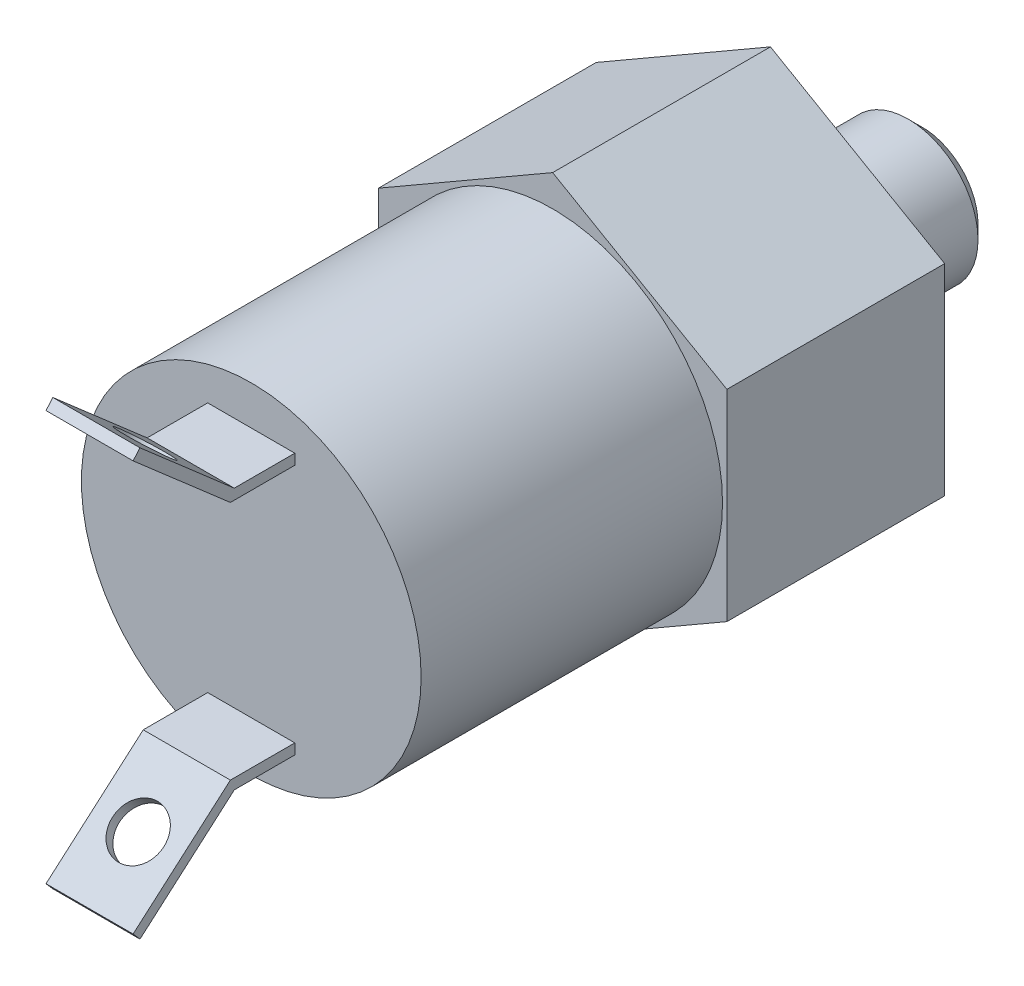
ISO-10303-21;
HEADER;
FILE_DESCRIPTION(('STEP AP214'),'2;1');
FILE_NAME('part.step','',(''),(''),'','','');
FILE_SCHEMA(('AUTOMOTIVE_DESIGN { 1 0 10303 214 1 1 1 1 }'));
ENDSEC;
DATA;
#1=APPLICATION_CONTEXT('core data for automotive mechanical design processes');
#2=APPLICATION_PROTOCOL_DEFINITION('international standard','automotive_design',2000,#1);
#3=PRODUCT_CONTEXT('',#1,'mechanical');
#4=PRODUCT('Part','Part','',(#3));
#5=PRODUCT_RELATED_PRODUCT_CATEGORY('part','',(#4));
#6=PRODUCT_DEFINITION_FORMATION('','',#4);
#7=PRODUCT_DEFINITION_CONTEXT('part definition',#1,'design');
#8=PRODUCT_DEFINITION('design','',#6,#7);
#9=PRODUCT_DEFINITION_SHAPE('','',#8);
#10=(LENGTH_UNIT() NAMED_UNIT(*) SI_UNIT(.MILLI.,.METRE.));
#11=(NAMED_UNIT(*) PLANE_ANGLE_UNIT() SI_UNIT($,.RADIAN.));
#12=(NAMED_UNIT(*) SI_UNIT($,.STERADIAN.) SOLID_ANGLE_UNIT());
#13=UNCERTAINTY_MEASURE_WITH_UNIT(LENGTH_MEASURE(1.E-05),#10,'distance_accuracy_value','');
#14=(GEOMETRIC_REPRESENTATION_CONTEXT(3) GLOBAL_UNCERTAINTY_ASSIGNED_CONTEXT((#13)) GLOBAL_UNIT_ASSIGNED_CONTEXT((#10,
#11,#12)) REPRESENTATION_CONTEXT('',''));
#15=CARTESIAN_POINT('',(0.,0.,0.));
#16=DIRECTION('',(0.,0.,1.));
#17=DIRECTION('',(1.,0.,0.));
#18=AXIS2_PLACEMENT_3D('',#15,#16,#17);
#19=CARTESIAN_POINT('',(0.,0.,8.9408));
#20=DIRECTION('',(0.,0.,1.));
#21=DIRECTION('',(1.,0.,0.));
#22=AXIS2_PLACEMENT_3D('',#19,#20,#21);
#23=PLANE('',#22);
#24=CARTESIAN_POINT('',(0.,0.,8.9408));
#25=DIRECTION('',(0.,0.,1.));
#26=DIRECTION('',(1.,0.,0.));
#27=AXIS2_PLACEMENT_3D('',#24,#25,#26);
#28=CIRCLE('',#27,1.5875);
#29=CARTESIAN_POINT('',(1.5875,0.,8.9408));
#30=VERTEX_POINT('',#29);
#31=EDGE_CURVE('E20',#30,#30,#28,.F.);
#32=ORIENTED_EDGE('',*,*,#31,.T.);
#33=EDGE_LOOP('',(#32));
#34=FACE_BOUND('',#33,.T.);
#35=ADVANCED_FACE('F17',(#34),#23,.F.);
#36=CARTESIAN_POINT('',(0.,0.,-11.049));
#37=DIRECTION('',(0.,0.,1.));
#38=DIRECTION('',(1.,0.,0.));
#39=AXIS2_PLACEMENT_3D('',#36,#37,#38);
#40=CYLINDRICAL_SURFACE('',#39,1.5875);
#41=CARTESIAN_POINT('',(0.,0.,-11.049));
#42=DIRECTION('',(0.,0.,1.));
#43=DIRECTION('',(1.,0.,0.));
#44=AXIS2_PLACEMENT_3D('',#41,#42,#43);
#45=CIRCLE('',#44,1.5875);
#46=CARTESIAN_POINT('',(1.5875,0.,-11.049));
#47=VERTEX_POINT('',#46);
#48=EDGE_CURVE('E220',#47,#47,#45,.F.);
#49=ORIENTED_EDGE('',*,*,#48,.T.);
#50=EDGE_LOOP('',(#49));
#51=FACE_BOUND('',#50,.T.);
#52=ORIENTED_EDGE('',*,*,#31,.F.);
#53=EDGE_LOOP('',(#52));
#54=FACE_BOUND('',#53,.T.);
#55=ADVANCED_FACE('F228',(#51,#54),#40,.F.);
#56=CARTESIAN_POINT('',(0.,0.,-11.049));
#57=DIRECTION('',(0.,0.,1.));
#58=DIRECTION('',(1.,0.,0.));
#59=AXIS2_PLACEMENT_3D('',#56,#57,#58);
#60=PLANE('',#59);
#61=ORIENTED_EDGE('',*,*,#48,.F.);
#62=EDGE_LOOP('',(#61));
#63=FACE_BOUND('',#62,.T.);
#64=CARTESIAN_POINT('',(0.,0.,-11.0490000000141));
#65=DIRECTION('',(0.,0.,1.));
#66=DIRECTION('',(1.,0.,0.));
#67=AXIS2_PLACEMENT_3D('',#64,#65,#66);
#68=CIRCLE('',#67,4.07999999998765);
#69=CARTESIAN_POINT('',(4.07999999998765,0.,-11.0490000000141));
#70=VERTEX_POINT('',#69);
#71=EDGE_CURVE('E197',#70,#70,#68,.T.);
#72=ORIENTED_EDGE('',*,*,#71,.F.);
#73=EDGE_LOOP('',(#72));
#74=FACE_BOUND('',#73,.T.);
#75=ADVANCED_FACE('F230',(#63,#74),#60,.F.);
#76=CARTESIAN_POINT('',(0.,0.,-10.0490000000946));
#77=DIRECTION('',(0.,0.,1.));
#78=DIRECTION('',(1.,0.,0.));
#79=AXIS2_PLACEMENT_3D('',#76,#77,#78);
#80=CONICAL_SURFACE('',#79,5.07999999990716,0.785398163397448);
#81=CARTESIAN_POINT('',(0.,0.,-10.049));
#82=DIRECTION('',(0.,0.,-1.));
#83=DIRECTION('',(-1.,0.,0.));
#84=AXIS2_PLACEMENT_3D('',#81,#82,#83);
#85=CIRCLE('',#84,5.08);
#86=CARTESIAN_POINT('',(-5.08,0.,-10.049));
#87=VERTEX_POINT('',#86);
#88=EDGE_CURVE('E189',#87,#87,#85,.F.);
#89=ORIENTED_EDGE('',*,*,#88,.F.);
#90=EDGE_LOOP('',(#89));
#91=FACE_BOUND('',#90,.T.);
#92=ORIENTED_EDGE('',*,*,#71,.T.);
#93=EDGE_LOOP('',(#92));
#94=FACE_BOUND('',#93,.T.);
#95=ADVANCED_FACE('F236',(#91,#94),#80,.T.);
#96=CARTESIAN_POINT('',(0.,0.,0.));
#97=DIRECTION('',(0.,0.,-1.));
#98=DIRECTION('',(-1.,0.,0.));
#99=AXIS2_PLACEMENT_3D('',#96,#97,#98);
#100=CYLINDRICAL_SURFACE('',#99,5.08);
#101=CARTESIAN_POINT('',(0.,0.,-3.175));
#102=DIRECTION('',(0.,0.,1.));
#103=DIRECTION('',(1.,0.,0.));
#104=AXIS2_PLACEMENT_3D('',#101,#102,#103);
#105=CIRCLE('',#104,5.08);
#106=CARTESIAN_POINT('',(5.08,0.,-3.175));
#107=VERTEX_POINT('',#106);
#108=EDGE_CURVE('E150',#107,#107,#105,.F.);
#109=ORIENTED_EDGE('',*,*,#108,.T.);
#110=EDGE_LOOP('',(#109));
#111=FACE_BOUND('',#110,.T.);
#112=ORIENTED_EDGE('',*,*,#88,.T.);
#113=EDGE_LOOP('',(#112));
#114=FACE_BOUND('',#113,.T.);
#115=ADVANCED_FACE('F482',(#111,#114),#100,.T.);
#116=CARTESIAN_POINT('',(0.,-15.5086137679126,49.1328481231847));
#117=DIRECTION('',(0.,-0.656617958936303,0.754223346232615));
#118=DIRECTION('',(0.,-0.754223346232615,-0.656617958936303));
#119=AXIS2_PLACEMENT_3D('',#116,#117,#118);
#120=PLANE('',#119);
#121=DIRECTION('',(0.,-0.754223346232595,-0.656617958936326));
#122=VECTOR('',#121,1.);
#123=CARTESIAN_POINT('',(-3.175,-14.9338955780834,49.6331910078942));
#124=LINE('',#123,#122);
#125=CARTESIAN_POINT('',(-3.175,-14.9338955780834,49.6331910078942));
#126=VERTEX_POINT('',#125);
#127=CARTESIAN_POINT('',(-3.175,-15.5086137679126,49.1328481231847));
#128=VERTEX_POINT('',#127);
#129=EDGE_CURVE('E139',#126,#128,#124,.T.);
#130=ORIENTED_EDGE('',*,*,#129,.T.);
#131=DIRECTION('',(1.,0.,0.));
#132=VECTOR('',#131,1.);
#133=CARTESIAN_POINT('',(0.,-15.5086137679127,49.1328481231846));
#134=LINE('',#133,#132);
#135=CARTESIAN_POINT('',(3.175,-15.5086137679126,49.1328481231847));
#136=VERTEX_POINT('',#135);
#137=EDGE_CURVE('E141',#136,#128,#134,.F.);
#138=ORIENTED_EDGE('',*,*,#137,.F.);
#139=DIRECTION('',(0.,-0.754223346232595,-0.656617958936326));
#140=VECTOR('',#139,1.);
#141=CARTESIAN_POINT('',(3.175,-14.9338955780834,49.6331910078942));
#142=LINE('',#141,#140);
#143=CARTESIAN_POINT('',(3.175,-14.9338955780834,49.6331910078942));
#144=VERTEX_POINT('',#143);
#145=EDGE_CURVE('E145',#144,#136,#142,.T.);
#146=ORIENTED_EDGE('',*,*,#145,.F.);
#147=DIRECTION('',(1.,0.,0.));
#148=VECTOR('',#147,1.);
#149=CARTESIAN_POINT('',(0.,-14.9338955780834,49.6331910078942));
#150=LINE('',#149,#148);
#151=EDGE_CURVE('E216',#126,#144,#150,.T.);
#152=ORIENTED_EDGE('',*,*,#151,.F.);
#153=EDGE_LOOP('',(#130,#138,#146,#152));
#154=FACE_BOUND('',#153,.T.);
#155=ADVANCED_FACE('F143',(#154),#120,.T.);
#156=CARTESIAN_POINT('',(0.,-11.8484477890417,46.089095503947));
#157=DIRECTION('',(0.,-0.754223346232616,-0.656617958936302));
#158=DIRECTION('',(0.,0.656617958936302,-0.754223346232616));
#159=AXIS2_PLACEMENT_3D('',#156,#157,#158);
#160=CYLINDRICAL_SURFACE('',#159,1.87126629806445);
#161=CARTESIAN_POINT('',(0.,-11.8484477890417,46.089095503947));
#162=DIRECTION('',(0.,-0.754223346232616,-0.656617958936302));
#163=DIRECTION('',(0.,0.656617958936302,-0.754223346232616));
#164=AXIS2_PLACEMENT_3D('',#161,#162,#163);
#165=CIRCLE('',#164,1.87126629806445);
#166=CARTESIAN_POINT('',(0.,-10.6197407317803,44.6777427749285));
#167=VERTEX_POINT('',#166);
#168=EDGE_CURVE('E213',#167,#167,#165,.T.);
#169=ORIENTED_EDGE('',*,*,#168,.F.);
#170=EDGE_LOOP('',(#169));
#171=FACE_BOUND('',#170,.T.);
#172=CARTESIAN_POINT('',(0.,-12.4231659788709,45.5887526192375));
#173=DIRECTION('',(0.,-0.754223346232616,-0.656617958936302));
#174=DIRECTION('',(0.,0.656617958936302,-0.754223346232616));
#175=AXIS2_PLACEMENT_3D('',#172,#173,#174);
#176=CIRCLE('',#175,1.87126629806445);
#177=CARTESIAN_POINT('',(0.,-11.1944589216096,44.177399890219));
#178=VERTEX_POINT('',#177);
#179=EDGE_CURVE('E149',#178,#178,#176,.F.);
#180=ORIENTED_EDGE('',*,*,#179,.F.);
#181=EDGE_LOOP('',(#180));
#182=FACE_BOUND('',#181,.T.);
#183=ADVANCED_FACE('F471',(#171,#182),#160,.F.);
#184=CARTESIAN_POINT('',(0.,14.9338955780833,49.6331910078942));
#185=DIRECTION('',(0.,0.656617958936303,0.754223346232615));
#186=DIRECTION('',(0.,-0.754223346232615,0.656617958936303));
#187=AXIS2_PLACEMENT_3D('',#184,#185,#186);
#188=PLANE('',#187);
#189=DIRECTION('',(0.,-0.75422334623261,0.656617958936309));
#190=VECTOR('',#189,1.);
#191=CARTESIAN_POINT('',(-3.175,15.5086137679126,49.1328481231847));
#192=LINE('',#191,#190);
#193=CARTESIAN_POINT('',(-3.175,15.5086137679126,49.1328481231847));
#194=VERTEX_POINT('',#193);
#195=CARTESIAN_POINT('',(-3.175,14.9338955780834,49.6331910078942));
#196=VERTEX_POINT('',#195);
#197=EDGE_CURVE('E325',#194,#196,#192,.T.);
#198=ORIENTED_EDGE('',*,*,#197,.T.);
#199=DIRECTION('',(1.,0.,0.));
#200=VECTOR('',#199,1.);
#201=CARTESIAN_POINT('',(0.,14.9338955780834,49.6331910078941));
#202=LINE('',#201,#200);
#203=CARTESIAN_POINT('',(3.175,14.9338955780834,49.6331910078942));
#204=VERTEX_POINT('',#203);
#205=EDGE_CURVE('E212',#204,#196,#202,.F.);
#206=ORIENTED_EDGE('',*,*,#205,.F.);
#207=DIRECTION('',(0.,-0.75422334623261,0.656617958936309));
#208=VECTOR('',#207,1.);
#209=CARTESIAN_POINT('',(3.175,15.5086137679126,49.1328481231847));
#210=LINE('',#209,#208);
#211=CARTESIAN_POINT('',(3.175,15.5086137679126,49.1328481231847));
#212=VERTEX_POINT('',#211);
#213=EDGE_CURVE('E329',#212,#204,#210,.T.);
#214=ORIENTED_EDGE('',*,*,#213,.F.);
#215=DIRECTION('',(1.,0.,0.));
#216=VECTOR('',#215,1.);
#217=CARTESIAN_POINT('',(0.,15.5086137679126,49.1328481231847));
#218=LINE('',#217,#216);
#219=EDGE_CURVE('E207',#194,#212,#218,.T.);
#220=ORIENTED_EDGE('',*,*,#219,.F.);
#221=EDGE_LOOP('',(#198,#206,#214,#220));
#222=FACE_BOUND('',#221,.T.);
#223=ADVANCED_FACE('F469',(#222),#188,.T.);
#224=CARTESIAN_POINT('',(0.,11.8484477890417,46.089095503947));
#225=DIRECTION('',(0.,-0.754223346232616,0.656617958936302));
#226=DIRECTION('',(0.,-0.656617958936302,-0.754223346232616));
#227=AXIS2_PLACEMENT_3D('',#224,#225,#226);
#228=CYLINDRICAL_SURFACE('',#227,1.87126629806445);
#229=CARTESIAN_POINT('',(0.,11.8484477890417,46.089095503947));
#230=DIRECTION('',(0.,-0.754223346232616,0.656617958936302));
#231=DIRECTION('',(0.,-0.656617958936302,-0.754223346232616));
#232=AXIS2_PLACEMENT_3D('',#229,#230,#231);
#233=CIRCLE('',#232,1.87126629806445);
#234=CARTESIAN_POINT('',(0.,10.6197407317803,44.6777427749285));
#235=VERTEX_POINT('',#234);
#236=EDGE_CURVE('E208',#235,#235,#233,.F.);
#237=ORIENTED_EDGE('',*,*,#236,.F.);
#238=EDGE_LOOP('',(#237));
#239=FACE_BOUND('',#238,.T.);
#240=CARTESIAN_POINT('',(0.,12.4231659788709,45.5887526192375));
#241=DIRECTION('',(0.,-0.754223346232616,0.656617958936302));
#242=DIRECTION('',(0.,-0.656617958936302,-0.754223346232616));
#243=AXIS2_PLACEMENT_3D('',#240,#241,#242);
#244=CIRCLE('',#243,1.87126629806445);
#245=CARTESIAN_POINT('',(0.,11.1944589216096,44.177399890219));
#246=VERTEX_POINT('',#245);
#247=EDGE_CURVE('E203',#246,#246,#244,.T.);
#248=ORIENTED_EDGE('',*,*,#247,.F.);
#249=EDGE_LOOP('',(#248));
#250=FACE_BOUND('',#249,.T.);
#251=ADVANCED_FACE('F179',(#239,#250),#228,.F.);
#252=CARTESIAN_POINT('',(0.,0.,-3.175));
#253=DIRECTION('',(0.,0.,1.));
#254=DIRECTION('',(1.,0.,0.));
#255=AXIS2_PLACEMENT_3D('',#252,#253,#254);
#256=TOROIDAL_SURFACE('',#255,8.255,3.175);
#257=CARTESIAN_POINT('',(0.,0.,0.));
#258=DIRECTION('',(0.,0.,-1.));
#259=DIRECTION('',(-1.,0.,0.));
#260=AXIS2_PLACEMENT_3D('',#257,#258,#259);
#261=CIRCLE('',#260,8.25500000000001);
#262=CARTESIAN_POINT('',(-8.255,0.,0.));
#263=VERTEX_POINT('',#262);
#264=EDGE_CURVE('E206',#263,#263,#261,.T.);
#265=ORIENTED_EDGE('',*,*,#264,.T.);
#266=EDGE_LOOP('',(#265));
#267=FACE_BOUND('',#266,.T.);
#268=ORIENTED_EDGE('',*,*,#108,.F.);
#269=EDGE_LOOP('',(#268));
#270=FACE_BOUND('',#269,.T.);
#271=ADVANCED_FACE('F174',(#267,#270),#256,.F.);
#272=CARTESIAN_POINT('',(0.,-9.525,42.2597781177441));
#273=DIRECTION('',(0.,-0.754223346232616,-0.656617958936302));
#274=DIRECTION('',(0.,0.656617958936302,-0.754223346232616));
#275=AXIS2_PLACEMENT_3D('',#272,#273,#274);
#276=PLANE('',#275);
#277=ORIENTED_EDGE('',*,*,#179,.T.);
#278=EDGE_LOOP('',(#277));
#279=FACE_BOUND('',#278,.T.);
#280=DIRECTION('',(0.,0.656617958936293,-0.754223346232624));
#281=VECTOR('',#280,1.);
#282=CARTESIAN_POINT('',(-3.175,-15.5086137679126,49.1328481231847));
#283=LINE('',#282,#281);
#284=CARTESIAN_POINT('',(-3.175,-9.525,42.2597781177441));
#285=VERTEX_POINT('',#284);
#286=EDGE_CURVE('E342',#128,#285,#283,.T.);
#287=ORIENTED_EDGE('',*,*,#286,.T.);
#288=DIRECTION('',(1.,0.,0.));
#289=VECTOR('',#288,1.);
#290=CARTESIAN_POINT('',(0.,-9.525,42.2597781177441));
#291=LINE('',#290,#289);
#292=CARTESIAN_POINT('',(3.175,-9.525,42.2597781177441));
#293=VERTEX_POINT('',#292);
#294=EDGE_CURVE('E156',#293,#285,#291,.F.);
#295=ORIENTED_EDGE('',*,*,#294,.F.);
#296=DIRECTION('',(0.,0.656617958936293,-0.754223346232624));
#297=VECTOR('',#296,1.);
#298=CARTESIAN_POINT('',(3.175,-15.5086137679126,49.1328481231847));
#299=LINE('',#298,#297);
#300=EDGE_CURVE('E153',#136,#293,#299,.T.);
#301=ORIENTED_EDGE('',*,*,#300,.F.);
#302=ORIENTED_EDGE('',*,*,#137,.T.);
#303=EDGE_LOOP('',(#287,#295,#301,#302));
#304=FACE_BOUND('',#303,.T.);
#305=ADVANCED_FACE('F154',(#279,#304),#276,.T.);
#306=CARTESIAN_POINT('',(3.175,-11.2256235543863,43.9727229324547));
#307=DIRECTION('',(1.,0.,0.));
#308=DIRECTION('',(0.,0.,-1.));
#309=AXIS2_PLACEMENT_3D('',#306,#307,#308);
#310=PLANE('',#309);
#311=ORIENTED_EDGE('',*,*,#300,.T.);
#312=DIRECTION('',(0.,0.,-1.));
#313=VECTOR('',#312,1.);
#314=CARTESIAN_POINT('',(3.175,-9.525,37.846));
#315=LINE('',#314,#313);
#316=CARTESIAN_POINT('',(3.175,-9.525,37.846));
#317=VERTEX_POINT('',#316);
#318=EDGE_CURVE('E353',#317,#293,#315,.F.);
#319=ORIENTED_EDGE('',*,*,#318,.F.);
#320=DIRECTION('',(0.,1.,0.));
#321=VECTOR('',#320,1.);
#322=CARTESIAN_POINT('',(3.175,-11.2256235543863,37.846));
#323=LINE('',#322,#321);
#324=CARTESIAN_POINT('',(3.175,-8.763,37.846));
#325=VERTEX_POINT('',#324);
#326=EDGE_CURVE('E165',#317,#325,#323,.T.);
#327=ORIENTED_EDGE('',*,*,#326,.T.);
#328=DIRECTION('',(0.,0.,1.));
#329=VECTOR('',#328,1.);
#330=CARTESIAN_POINT('',(3.175,-8.763,42.545));
#331=LINE('',#330,#329);
#332=CARTESIAN_POINT('',(3.175,-8.76299999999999,42.545));
#333=VERTEX_POINT('',#332);
#334=EDGE_CURVE('E351',#333,#325,#331,.F.);
#335=ORIENTED_EDGE('',*,*,#334,.F.);
#336=DIRECTION('',(0.,-0.656617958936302,0.754223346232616));
#337=VECTOR('',#336,1.);
#338=CARTESIAN_POINT('',(3.175,-14.9338955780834,49.6331910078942));
#339=LINE('',#338,#337);
#340=EDGE_CURVE('E163',#144,#333,#339,.F.);
#341=ORIENTED_EDGE('',*,*,#340,.F.);
#342=ORIENTED_EDGE('',*,*,#145,.T.);
#343=EDGE_LOOP('',(#311,#319,#327,#335,#341,#342));
#344=FACE_BOUND('',#343,.T.);
#345=ADVANCED_FACE('F161',(#344),#310,.T.);
#346=CARTESIAN_POINT('',(-3.175,-11.2256235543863,43.9727229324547));
#347=DIRECTION('',(1.,0.,0.));
#348=DIRECTION('',(0.,0.,-1.));
#349=AXIS2_PLACEMENT_3D('',#346,#347,#348);
#350=PLANE('',#349);
#351=DIRECTION('',(0.,0.,1.));
#352=VECTOR('',#351,1.);
#353=CARTESIAN_POINT('',(-3.175,-8.763,42.545));
#354=LINE('',#353,#352);
#355=CARTESIAN_POINT('',(-3.175,-8.763,37.846));
#356=VERTEX_POINT('',#355);
#357=CARTESIAN_POINT('',(-3.175,-8.76299999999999,42.545));
#358=VERTEX_POINT('',#357);
#359=EDGE_CURVE('E358',#356,#358,#354,.T.);
#360=ORIENTED_EDGE('',*,*,#359,.F.);
#361=DIRECTION('',(0.,1.,0.));
#362=VECTOR('',#361,1.);
#363=CARTESIAN_POINT('',(-3.175,-11.2256235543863,37.846));
#364=LINE('',#363,#362);
#365=CARTESIAN_POINT('',(-3.175,-9.525,37.846));
#366=VERTEX_POINT('',#365);
#367=EDGE_CURVE('E340',#366,#356,#364,.T.);
#368=ORIENTED_EDGE('',*,*,#367,.F.);
#369=DIRECTION('',(0.,0.,-1.));
#370=VECTOR('',#369,1.);
#371=CARTESIAN_POINT('',(-3.175,-9.525,37.846));
#372=LINE('',#371,#370);
#373=EDGE_CURVE('E346',#285,#366,#372,.T.);
#374=ORIENTED_EDGE('',*,*,#373,.F.);
#375=ORIENTED_EDGE('',*,*,#286,.F.);
#376=ORIENTED_EDGE('',*,*,#129,.F.);
#377=DIRECTION('',(0.,-0.656617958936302,0.754223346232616));
#378=VECTOR('',#377,1.);
#379=CARTESIAN_POINT('',(-3.175,-14.9338955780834,49.6331910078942));
#380=LINE('',#379,#378);
#381=EDGE_CURVE('E336',#358,#126,#380,.T.);
#382=ORIENTED_EDGE('',*,*,#381,.F.);
#383=EDGE_LOOP('',(#360,#368,#374,#375,#376,#382));
#384=FACE_BOUND('',#383,.T.);
#385=ADVANCED_FACE('F348',(#384),#350,.F.);
#386=CARTESIAN_POINT('',(0.,-14.9338955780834,49.6331910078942));
#387=DIRECTION('',(0.,0.754223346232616,0.656617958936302));
#388=DIRECTION('',(0.,-0.656617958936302,0.754223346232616));
#389=AXIS2_PLACEMENT_3D('',#386,#387,#388);
#390=PLANE('',#389);
#391=ORIENTED_EDGE('',*,*,#168,.T.);
#392=EDGE_LOOP('',(#391));
#393=FACE_BOUND('',#392,.T.);
#394=ORIENTED_EDGE('',*,*,#381,.T.);
#395=ORIENTED_EDGE('',*,*,#151,.T.);
#396=ORIENTED_EDGE('',*,*,#340,.T.);
#397=DIRECTION('',(1.,0.,0.));
#398=VECTOR('',#397,1.);
#399=CARTESIAN_POINT('',(0.,-8.763,42.545));
#400=LINE('',#399,#398);
#401=EDGE_CURVE('E361',#358,#333,#400,.T.);
#402=ORIENTED_EDGE('',*,*,#401,.F.);
#403=EDGE_LOOP('',(#394,#395,#396,#402));
#404=FACE_BOUND('',#403,.T.);
#405=ADVANCED_FACE('F556',(#393,#404),#390,.T.);
#406=CARTESIAN_POINT('',(0.,8.763,42.545));
#407=DIRECTION('',(0.,-0.754223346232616,0.656617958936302));
#408=DIRECTION('',(0.,-0.656617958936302,-0.754223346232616));
#409=AXIS2_PLACEMENT_3D('',#406,#407,#408);
#410=PLANE('',#409);
#411=ORIENTED_EDGE('',*,*,#236,.T.);
#412=EDGE_LOOP('',(#411));
#413=FACE_BOUND('',#412,.T.);
#414=DIRECTION('',(0.,-0.656617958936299,-0.754223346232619));
#415=VECTOR('',#414,1.);
#416=CARTESIAN_POINT('',(-3.175,14.9338955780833,49.6331910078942));
#417=LINE('',#416,#415);
#418=CARTESIAN_POINT('',(-3.175,8.763,42.545));
#419=VERTEX_POINT('',#418);
#420=EDGE_CURVE('E323',#196,#419,#417,.T.);
#421=ORIENTED_EDGE('',*,*,#420,.T.);
#422=DIRECTION('',(1.,0.,0.));
#423=VECTOR('',#422,1.);
#424=CARTESIAN_POINT('',(0.,8.763,42.545));
#425=LINE('',#424,#423);
#426=CARTESIAN_POINT('',(3.175,8.763,42.545));
#427=VERTEX_POINT('',#426);
#428=EDGE_CURVE('E367',#427,#419,#425,.F.);
#429=ORIENTED_EDGE('',*,*,#428,.F.);
#430=DIRECTION('',(0.,-0.656617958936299,-0.754223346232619));
#431=VECTOR('',#430,1.);
#432=CARTESIAN_POINT('',(3.175,14.9338955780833,49.6331910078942));
#433=LINE('',#432,#431);
#434=EDGE_CURVE('E327',#204,#427,#433,.T.);
#435=ORIENTED_EDGE('',*,*,#434,.F.);
#436=ORIENTED_EDGE('',*,*,#205,.T.);
#437=EDGE_LOOP('',(#421,#429,#435,#436));
#438=FACE_BOUND('',#437,.T.);
#439=ADVANCED_FACE('F467',(#413,#438),#410,.T.);
#440=CARTESIAN_POINT('',(3.175,11.2256235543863,43.9727229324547));
#441=DIRECTION('',(1.,0.,0.));
#442=DIRECTION('',(0.,0.,-1.));
#443=AXIS2_PLACEMENT_3D('',#440,#441,#442);
#444=PLANE('',#443);
#445=ORIENTED_EDGE('',*,*,#434,.T.);
#446=DIRECTION('',(0.,0.,-1.));
#447=VECTOR('',#446,1.);
#448=CARTESIAN_POINT('',(3.175,8.763,37.846));
#449=LINE('',#448,#447);
#450=CARTESIAN_POINT('',(3.175,8.763,37.846));
#451=VERTEX_POINT('',#450);
#452=EDGE_CURVE('E364',#451,#427,#449,.F.);
#453=ORIENTED_EDGE('',*,*,#452,.F.);
#454=DIRECTION('',(0.,1.,0.));
#455=VECTOR('',#454,1.);
#456=CARTESIAN_POINT('',(3.175,11.2256235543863,37.846));
#457=LINE('',#456,#455);
#458=CARTESIAN_POINT('',(3.175,9.525,37.846));
#459=VERTEX_POINT('',#458);
#460=EDGE_CURVE('E211',#451,#459,#457,.T.);
#461=ORIENTED_EDGE('',*,*,#460,.T.);
#462=DIRECTION('',(0.,0.,1.));
#463=VECTOR('',#462,1.);
#464=CARTESIAN_POINT('',(3.175,9.525,42.2597781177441));
#465=LINE('',#464,#463);
#466=CARTESIAN_POINT('',(3.175,9.52499999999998,42.2597781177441));
#467=VERTEX_POINT('',#466);
#468=EDGE_CURVE('E373',#467,#459,#465,.F.);
#469=ORIENTED_EDGE('',*,*,#468,.F.);
#470=DIRECTION('',(0.,0.656617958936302,0.754223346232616));
#471=VECTOR('',#470,1.);
#472=CARTESIAN_POINT('',(3.175,15.5086137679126,49.1328481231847));
#473=LINE('',#472,#471);
#474=EDGE_CURVE('E318',#212,#467,#473,.F.);
#475=ORIENTED_EDGE('',*,*,#474,.F.);
#476=ORIENTED_EDGE('',*,*,#213,.T.);
#477=EDGE_LOOP('',(#445,#453,#461,#469,#475,#476));
#478=FACE_BOUND('',#477,.T.);
#479=ADVANCED_FACE('F463',(#478),#444,.T.);
#480=CARTESIAN_POINT('',(-3.175,11.2256235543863,43.9727229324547));
#481=DIRECTION('',(1.,0.,0.));
#482=DIRECTION('',(0.,0.,-1.));
#483=AXIS2_PLACEMENT_3D('',#480,#481,#482);
#484=PLANE('',#483);
#485=DIRECTION('',(0.,0.,1.));
#486=VECTOR('',#485,1.);
#487=CARTESIAN_POINT('',(-3.175,9.525,42.2597781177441));
#488=LINE('',#487,#486);
#489=CARTESIAN_POINT('',(-3.175,9.525,37.846));
#490=VERTEX_POINT('',#489);
#491=CARTESIAN_POINT('',(-3.175,9.52499999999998,42.2597781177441));
#492=VERTEX_POINT('',#491);
#493=EDGE_CURVE('E376',#490,#492,#488,.T.);
#494=ORIENTED_EDGE('',*,*,#493,.F.);
#495=DIRECTION('',(0.,1.,0.));
#496=VECTOR('',#495,1.);
#497=CARTESIAN_POINT('',(-3.175,11.2256235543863,37.846));
#498=LINE('',#497,#496);
#499=CARTESIAN_POINT('',(-3.175,8.763,37.846));
#500=VERTEX_POINT('',#499);
#501=EDGE_CURVE('E321',#500,#490,#498,.T.);
#502=ORIENTED_EDGE('',*,*,#501,.F.);
#503=DIRECTION('',(0.,0.,-1.));
#504=VECTOR('',#503,1.);
#505=CARTESIAN_POINT('',(-3.175,8.763,37.846));
#506=LINE('',#505,#504);
#507=EDGE_CURVE('E370',#419,#500,#506,.T.);
#508=ORIENTED_EDGE('',*,*,#507,.F.);
#509=ORIENTED_EDGE('',*,*,#420,.F.);
#510=ORIENTED_EDGE('',*,*,#197,.F.);
#511=DIRECTION('',(0.,0.656617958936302,0.754223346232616));
#512=VECTOR('',#511,1.);
#513=CARTESIAN_POINT('',(-3.175,15.5086137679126,49.1328481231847));
#514=LINE('',#513,#512);
#515=EDGE_CURVE('E315',#492,#194,#514,.T.);
#516=ORIENTED_EDGE('',*,*,#515,.F.);
#517=EDGE_LOOP('',(#494,#502,#508,#509,#510,#516));
#518=FACE_BOUND('',#517,.T.);
#519=ADVANCED_FACE('F456',(#518),#484,.F.);
#520=CARTESIAN_POINT('',(0.,15.5086137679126,49.1328481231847));
#521=DIRECTION('',(0.,0.754223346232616,-0.656617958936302));
#522=DIRECTION('',(0.,0.656617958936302,0.754223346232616));
#523=AXIS2_PLACEMENT_3D('',#520,#521,#522);
#524=PLANE('',#523);
#525=ORIENTED_EDGE('',*,*,#247,.T.);
#526=EDGE_LOOP('',(#525));
#527=FACE_BOUND('',#526,.T.);
#528=ORIENTED_EDGE('',*,*,#515,.T.);
#529=ORIENTED_EDGE('',*,*,#219,.T.);
#530=ORIENTED_EDGE('',*,*,#474,.T.);
#531=DIRECTION('',(1.,0.,0.));
#532=VECTOR('',#531,1.);
#533=CARTESIAN_POINT('',(0.,9.525,42.2597781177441));
#534=LINE('',#533,#532);
#535=EDGE_CURVE('E379',#492,#467,#534,.T.);
#536=ORIENTED_EDGE('',*,*,#535,.F.);
#537=EDGE_LOOP('',(#528,#529,#530,#536));
#538=FACE_BOUND('',#537,.T.);
#539=ADVANCED_FACE('F298',(#527,#538),#524,.T.);
#540=CARTESIAN_POINT('',(0.,0.,0.));
#541=DIRECTION('',(0.,0.,1.));
#542=DIRECTION('',(1.,0.,0.));
#543=AXIS2_PLACEMENT_3D('',#540,#541,#542);
#544=PLANE('',#543);
#545=ORIENTED_EDGE('',*,*,#264,.F.);
#546=EDGE_LOOP('',(#545));
#547=FACE_BOUND('',#546,.T.);
#548=DIRECTION('',(0.,1.,0.));
#549=VECTOR('',#548,1.);
#550=CARTESIAN_POINT('',(12.7,7.33234841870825,0.));
#551=LINE('',#550,#549);
#552=CARTESIAN_POINT('',(12.7,-7.33234841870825,0.));
#553=VERTEX_POINT('',#552);
#554=CARTESIAN_POINT('',(12.7,7.33234841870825,0.));
#555=VERTEX_POINT('',#554);
#556=EDGE_CURVE('E382',#553,#555,#551,.T.);
#557=ORIENTED_EDGE('',*,*,#556,.F.);
#558=DIRECTION('',(0.866025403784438,0.500000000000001,0.));
#559=VECTOR('',#558,1.);
#560=CARTESIAN_POINT('',(12.7,-7.33234841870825,0.));
#561=LINE('',#560,#559);
#562=CARTESIAN_POINT('',(0.,-14.6646968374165,0.));
#563=VERTEX_POINT('',#562);
#564=EDGE_CURVE('E405',#563,#553,#561,.T.);
#565=ORIENTED_EDGE('',*,*,#564,.F.);
#566=DIRECTION('',(0.866025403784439,-0.5,0.));
#567=VECTOR('',#566,1.);
#568=CARTESIAN_POINT('',(0.,-14.6646968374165,0.));
#569=LINE('',#568,#567);
#570=CARTESIAN_POINT('',(-12.7,-7.33234841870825,0.));
#571=VERTEX_POINT('',#570);
#572=EDGE_CURVE('E402',#571,#563,#569,.T.);
#573=ORIENTED_EDGE('',*,*,#572,.F.);
#574=DIRECTION('',(0.,-1.,0.));
#575=VECTOR('',#574,1.);
#576=CARTESIAN_POINT('',(-12.7,-7.33234841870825,0.));
#577=LINE('',#576,#575);
#578=CARTESIAN_POINT('',(-12.7,7.33234841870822,0.));
#579=VERTEX_POINT('',#578);
#580=EDGE_CURVE('E397',#579,#571,#577,.T.);
#581=ORIENTED_EDGE('',*,*,#580,.F.);
#582=DIRECTION('',(-0.866025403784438,-0.5,0.));
#583=VECTOR('',#582,1.);
#584=CARTESIAN_POINT('',(-12.7,7.33234841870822,0.));
#585=LINE('',#584,#583);
#586=CARTESIAN_POINT('',(0.,14.6646968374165,0.));
#587=VERTEX_POINT('',#586);
#588=EDGE_CURVE('E392',#587,#579,#585,.T.);
#589=ORIENTED_EDGE('',*,*,#588,.F.);
#590=DIRECTION('',(-0.866025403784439,0.5,0.));
#591=VECTOR('',#590,1.);
#592=CARTESIAN_POINT('',(0.,14.6646968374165,0.));
#593=LINE('',#592,#591);
#594=EDGE_CURVE('E387',#555,#587,#593,.T.);
#595=ORIENTED_EDGE('',*,*,#594,.F.);
#596=EDGE_LOOP('',(#557,#565,#573,#581,#589,#595));
#597=FACE_BOUND('',#596,.T.);
#598=ADVANCED_FACE('F293',(#547,#597),#544,.F.);
#599=CARTESIAN_POINT('',(0.,-9.525,37.846));
#600=DIRECTION('',(0.,-1.,0.));
#601=DIRECTION('',(0.,0.,-1.));
#602=AXIS2_PLACEMENT_3D('',#599,#600,#601);
#603=PLANE('',#602);
#604=ORIENTED_EDGE('',*,*,#373,.T.);
#605=DIRECTION('',(-1.,0.,0.));
#606=VECTOR('',#605,1.);
#607=CARTESIAN_POINT('',(0.,-9.525,37.846));
#608=LINE('',#607,#606);
#609=EDGE_CURVE('E411',#366,#317,#608,.F.);
#610=ORIENTED_EDGE('',*,*,#609,.T.);
#611=ORIENTED_EDGE('',*,*,#318,.T.);
#612=ORIENTED_EDGE('',*,*,#294,.T.);
#613=EDGE_LOOP('',(#604,#610,#611,#612));
#614=FACE_BOUND('',#613,.T.);
#615=ADVANCED_FACE('F289',(#614),#603,.T.);
#616=CARTESIAN_POINT('',(0.,-8.763,42.545));
#617=DIRECTION('',(0.,1.,0.));
#618=DIRECTION('',(0.,0.,1.));
#619=AXIS2_PLACEMENT_3D('',#616,#617,#618);
#620=PLANE('',#619);
#621=ORIENTED_EDGE('',*,*,#359,.T.);
#622=ORIENTED_EDGE('',*,*,#401,.T.);
#623=ORIENTED_EDGE('',*,*,#334,.T.);
#624=DIRECTION('',(-1.,0.,0.));
#625=VECTOR('',#624,1.);
#626=CARTESIAN_POINT('',(0.,-8.763,37.846));
#627=LINE('',#626,#625);
#628=EDGE_CURVE('E413',#325,#356,#627,.T.);
#629=ORIENTED_EDGE('',*,*,#628,.T.);
#630=EDGE_LOOP('',(#621,#622,#623,#629));
#631=FACE_BOUND('',#630,.T.);
#632=ADVANCED_FACE('F285',(#631),#620,.T.);
#633=CARTESIAN_POINT('',(0.,8.763,37.846));
#634=DIRECTION('',(0.,-1.,0.));
#635=DIRECTION('',(0.,0.,-1.));
#636=AXIS2_PLACEMENT_3D('',#633,#634,#635);
#637=PLANE('',#636);
#638=ORIENTED_EDGE('',*,*,#507,.T.);
#639=DIRECTION('',(-1.,0.,0.));
#640=VECTOR('',#639,1.);
#641=CARTESIAN_POINT('',(0.,8.763,37.846));
#642=LINE('',#641,#640);
#643=EDGE_CURVE('E416',#500,#451,#642,.F.);
#644=ORIENTED_EDGE('',*,*,#643,.T.);
#645=ORIENTED_EDGE('',*,*,#452,.T.);
#646=ORIENTED_EDGE('',*,*,#428,.T.);
#647=EDGE_LOOP('',(#638,#644,#645,#646));
#648=FACE_BOUND('',#647,.T.);
#649=ADVANCED_FACE('F281',(#648),#637,.T.);
#650=CARTESIAN_POINT('',(0.,9.525,42.2597781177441));
#651=DIRECTION('',(0.,1.,0.));
#652=DIRECTION('',(0.,0.,1.));
#653=AXIS2_PLACEMENT_3D('',#650,#651,#652);
#654=PLANE('',#653);
#655=ORIENTED_EDGE('',*,*,#493,.T.);
#656=ORIENTED_EDGE('',*,*,#535,.T.);
#657=ORIENTED_EDGE('',*,*,#468,.T.);
#658=DIRECTION('',(-1.,0.,0.));
#659=VECTOR('',#658,1.);
#660=CARTESIAN_POINT('',(0.,9.525,37.846));
#661=LINE('',#660,#659);
#662=EDGE_CURVE('E419',#459,#490,#661,.T.);
#663=ORIENTED_EDGE('',*,*,#662,.T.);
#664=EDGE_LOOP('',(#655,#656,#657,#663));
#665=FACE_BOUND('',#664,.T.);
#666=ADVANCED_FACE('F277',(#665),#654,.T.);
#667=CARTESIAN_POINT('',(12.7,7.33234841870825,0.));
#668=DIRECTION('',(1.,0.,0.));
#669=DIRECTION('',(0.,1.,0.));
#670=AXIS2_PLACEMENT_3D('',#667,#668,#669);
#671=PLANE('',#670);
#672=ORIENTED_EDGE('',*,*,#556,.T.);
#673=DIRECTION('',(0.,0.,1.));
#674=VECTOR('',#673,1.);
#675=CARTESIAN_POINT('',(12.7,7.33234841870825,0.));
#676=LINE('',#675,#674);
#677=CARTESIAN_POINT('',(12.7,7.33234841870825,15.875));
#678=VERTEX_POINT('',#677);
#679=EDGE_CURVE('E384',#678,#555,#676,.F.);
#680=ORIENTED_EDGE('',*,*,#679,.F.);
#681=DIRECTION('',(0.,1.,0.));
#682=VECTOR('',#681,1.);
#683=CARTESIAN_POINT('',(12.7,0.,15.875));
#684=LINE('',#683,#682);
#685=CARTESIAN_POINT('',(12.7,-7.33234841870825,15.875));
#686=VERTEX_POINT('',#685);
#687=EDGE_CURVE('E422',#686,#678,#684,.T.);
#688=ORIENTED_EDGE('',*,*,#687,.F.);
#689=DIRECTION('',(0.,0.,1.));
#690=VECTOR('',#689,1.);
#691=CARTESIAN_POINT('',(12.7,-7.33234841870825,0.));
#692=LINE('',#691,#690);
#693=EDGE_CURVE('E408',#553,#686,#692,.T.);
#694=ORIENTED_EDGE('',*,*,#693,.F.);
#695=EDGE_LOOP('',(#672,#680,#688,#694));
#696=FACE_BOUND('',#695,.T.);
#697=ADVANCED_FACE('F273',(#696),#671,.T.);
#698=CARTESIAN_POINT('',(0.,14.6646968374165,0.));
#699=DIRECTION('',(0.5,0.866025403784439,0.));
#700=DIRECTION('',(-0.866025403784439,0.5,0.));
#701=AXIS2_PLACEMENT_3D('',#698,#699,#700);
#702=PLANE('',#701);
#703=ORIENTED_EDGE('',*,*,#594,.T.);
#704=DIRECTION('',(0.,0.,1.));
#705=VECTOR('',#704,1.);
#706=CARTESIAN_POINT('',(0.,14.6646968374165,0.));
#707=LINE('',#706,#705);
#708=CARTESIAN_POINT('',(0.,14.6646968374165,15.875));
#709=VERTEX_POINT('',#708);
#710=EDGE_CURVE('E389',#709,#587,#707,.F.);
#711=ORIENTED_EDGE('',*,*,#710,.F.);
#712=DIRECTION('',(-0.866025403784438,0.5,0.));
#713=VECTOR('',#712,1.);
#714=CARTESIAN_POINT('',(12.7,7.33234841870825,15.875));
#715=LINE('',#714,#713);
#716=EDGE_CURVE('E425',#678,#709,#715,.T.);
#717=ORIENTED_EDGE('',*,*,#716,.F.);
#718=ORIENTED_EDGE('',*,*,#679,.T.);
#719=EDGE_LOOP('',(#703,#711,#717,#718));
#720=FACE_BOUND('',#719,.T.);
#721=ADVANCED_FACE('F269',(#720),#702,.T.);
#722=CARTESIAN_POINT('',(-12.7,7.33234841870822,0.));
#723=DIRECTION('',(-0.5,0.866025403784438,0.));
#724=DIRECTION('',(-0.866025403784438,-0.5,0.));
#725=AXIS2_PLACEMENT_3D('',#722,#723,#724);
#726=PLANE('',#725);
#727=ORIENTED_EDGE('',*,*,#588,.T.);
#728=DIRECTION('',(0.,0.,1.));
#729=VECTOR('',#728,1.);
#730=CARTESIAN_POINT('',(-12.7,7.33234841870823,0.));
#731=LINE('',#730,#729);
#732=CARTESIAN_POINT('',(-12.7,7.33234841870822,15.875));
#733=VERTEX_POINT('',#732);
#734=EDGE_CURVE('E394',#733,#579,#731,.F.);
#735=ORIENTED_EDGE('',*,*,#734,.F.);
#736=DIRECTION('',(-0.866025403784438,-0.500000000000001,0.));
#737=VECTOR('',#736,1.);
#738=CARTESIAN_POINT('',(0.,14.6646968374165,15.875));
#739=LINE('',#738,#737);
#740=EDGE_CURVE('E428',#709,#733,#739,.T.);
#741=ORIENTED_EDGE('',*,*,#740,.F.);
#742=ORIENTED_EDGE('',*,*,#710,.T.);
#743=EDGE_LOOP('',(#727,#735,#741,#742));
#744=FACE_BOUND('',#743,.T.);
#745=ADVANCED_FACE('F265',(#744),#726,.T.);
#746=CARTESIAN_POINT('',(-12.7,-7.33234841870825,0.));
#747=DIRECTION('',(-1.,0.,0.));
#748=DIRECTION('',(0.,-1.,0.));
#749=AXIS2_PLACEMENT_3D('',#746,#747,#748);
#750=PLANE('',#749);
#751=ORIENTED_EDGE('',*,*,#580,.T.);
#752=DIRECTION('',(0.,0.,1.));
#753=VECTOR('',#752,1.);
#754=CARTESIAN_POINT('',(-12.7,-7.33234841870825,0.));
#755=LINE('',#754,#753);
#756=CARTESIAN_POINT('',(-12.7,-7.33234841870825,15.875));
#757=VERTEX_POINT('',#756);
#758=EDGE_CURVE('E399',#757,#571,#755,.F.);
#759=ORIENTED_EDGE('',*,*,#758,.F.);
#760=DIRECTION('',(0.,1.,0.));
#761=VECTOR('',#760,1.);
#762=CARTESIAN_POINT('',(-12.7,0.,15.875));
#763=LINE('',#762,#761);
#764=EDGE_CURVE('E431',#733,#757,#763,.F.);
#765=ORIENTED_EDGE('',*,*,#764,.F.);
#766=ORIENTED_EDGE('',*,*,#734,.T.);
#767=EDGE_LOOP('',(#751,#759,#765,#766));
#768=FACE_BOUND('',#767,.T.);
#769=ADVANCED_FACE('F262',(#768),#750,.T.);
#770=CARTESIAN_POINT('',(0.,-14.6646968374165,0.));
#771=DIRECTION('',(-0.5,-0.866025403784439,0.));
#772=DIRECTION('',(0.866025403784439,-0.5,0.));
#773=AXIS2_PLACEMENT_3D('',#770,#771,#772);
#774=PLANE('',#773);
#775=ORIENTED_EDGE('',*,*,#572,.T.);
#776=DIRECTION('',(0.,0.,1.));
#777=VECTOR('',#776,1.);
#778=CARTESIAN_POINT('',(0.,-14.6646968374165,0.));
#779=LINE('',#778,#777);
#780=CARTESIAN_POINT('',(0.,-14.6646968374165,15.875));
#781=VERTEX_POINT('',#780);
#782=EDGE_CURVE('E35',#781,#563,#779,.F.);
#783=ORIENTED_EDGE('',*,*,#782,.F.);
#784=DIRECTION('',(0.866025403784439,-0.5,0.));
#785=VECTOR('',#784,1.);
#786=CARTESIAN_POINT('',(-12.7,-7.33234841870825,15.875));
#787=LINE('',#786,#785);
#788=EDGE_CURVE('E434',#757,#781,#787,.T.);
#789=ORIENTED_EDGE('',*,*,#788,.F.);
#790=ORIENTED_EDGE('',*,*,#758,.T.);
#791=EDGE_LOOP('',(#775,#783,#789,#790));
#792=FACE_BOUND('',#791,.T.);
#793=ADVANCED_FACE('F258',(#792),#774,.T.);
#794=CARTESIAN_POINT('',(12.7,-7.33234841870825,0.));
#795=DIRECTION('',(0.500000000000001,-0.866025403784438,0.));
#796=DIRECTION('',(0.866025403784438,0.500000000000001,0.));
#797=AXIS2_PLACEMENT_3D('',#794,#795,#796);
#798=PLANE('',#797);
#799=ORIENTED_EDGE('',*,*,#564,.T.);
#800=ORIENTED_EDGE('',*,*,#693,.T.);
#801=DIRECTION('',(0.866025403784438,0.5,0.));
#802=VECTOR('',#801,1.);
#803=CARTESIAN_POINT('',(0.,-14.6646968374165,15.875));
#804=LINE('',#803,#802);
#805=EDGE_CURVE('E202',#781,#686,#804,.T.);
#806=ORIENTED_EDGE('',*,*,#805,.F.);
#807=ORIENTED_EDGE('',*,*,#782,.T.);
#808=EDGE_LOOP('',(#799,#800,#806,#807));
#809=FACE_BOUND('',#808,.T.);
#810=ADVANCED_FACE('F254',(#809),#798,.T.);
#811=CARTESIAN_POINT('',(0.,0.,37.846));
#812=DIRECTION('',(0.,0.,-1.));
#813=DIRECTION('',(-1.,0.,0.));
#814=AXIS2_PLACEMENT_3D('',#811,#812,#813);
#815=PLANE('',#814);
#816=ORIENTED_EDGE('',*,*,#662,.F.);
#817=ORIENTED_EDGE('',*,*,#460,.F.);
#818=ORIENTED_EDGE('',*,*,#643,.F.);
#819=ORIENTED_EDGE('',*,*,#501,.T.);
#820=EDGE_LOOP('',(#816,#817,#818,#819));
#821=FACE_BOUND('',#820,.T.);
#822=ORIENTED_EDGE('',*,*,#628,.F.);
#823=ORIENTED_EDGE('',*,*,#326,.F.);
#824=ORIENTED_EDGE('',*,*,#609,.F.);
#825=ORIENTED_EDGE('',*,*,#367,.T.);
#826=EDGE_LOOP('',(#822,#823,#824,#825));
#827=FACE_BOUND('',#826,.T.);
#828=CARTESIAN_POINT('',(0.,0.,37.846));
#829=DIRECTION('',(0.,0.,1.));
#830=DIRECTION('',(1.,0.,0.));
#831=AXIS2_PLACEMENT_3D('',#828,#829,#830);
#832=CIRCLE('',#831,12.3825);
#833=CARTESIAN_POINT('',(12.3825,0.,37.846));
#834=VERTEX_POINT('',#833);
#835=EDGE_CURVE('E26',#834,#834,#832,.F.);
#836=ORIENTED_EDGE('',*,*,#835,.F.);
#837=EDGE_LOOP('',(#836));
#838=FACE_BOUND('',#837,.T.);
#839=ADVANCED_FACE('F247',(#821,#827,#838),#815,.F.);
#840=CARTESIAN_POINT('',(0.,0.,15.875));
#841=DIRECTION('',(0.,0.,1.));
#842=DIRECTION('',(1.,0.,0.));
#843=AXIS2_PLACEMENT_3D('',#840,#841,#842);
#844=PLANE('',#843);
#845=CARTESIAN_POINT('',(0.,0.,15.875));
#846=DIRECTION('',(0.,0.,1.));
#847=DIRECTION('',(1.,0.,0.));
#848=AXIS2_PLACEMENT_3D('',#845,#846,#847);
#849=CIRCLE('',#848,12.3825);
#850=CARTESIAN_POINT('',(12.3825,0.,15.875));
#851=VERTEX_POINT('',#850);
#852=EDGE_CURVE('E11',#851,#851,#849,.T.);
#853=ORIENTED_EDGE('',*,*,#852,.F.);
#854=EDGE_LOOP('',(#853));
#855=FACE_BOUND('',#854,.T.);
#856=ORIENTED_EDGE('',*,*,#788,.T.);
#857=ORIENTED_EDGE('',*,*,#805,.T.);
#858=ORIENTED_EDGE('',*,*,#687,.T.);
#859=ORIENTED_EDGE('',*,*,#716,.T.);
#860=ORIENTED_EDGE('',*,*,#740,.T.);
#861=ORIENTED_EDGE('',*,*,#764,.T.);
#862=EDGE_LOOP('',(#856,#857,#858,#859,#860,#861));
#863=FACE_BOUND('',#862,.T.);
#864=ADVANCED_FACE('F241',(#855,#863),#844,.T.);
#865=CARTESIAN_POINT('',(0.,0.,15.875));
#866=DIRECTION('',(0.,0.,1.));
#867=DIRECTION('',(1.,0.,0.));
#868=AXIS2_PLACEMENT_3D('',#865,#866,#867);
#869=CYLINDRICAL_SURFACE('',#868,12.3825);
#870=ORIENTED_EDGE('',*,*,#852,.T.);
#871=EDGE_LOOP('',(#870));
#872=FACE_BOUND('',#871,.T.);
#873=ORIENTED_EDGE('',*,*,#835,.T.);
#874=EDGE_LOOP('',(#873));
#875=FACE_BOUND('',#874,.T.);
#876=ADVANCED_FACE('F239',(#872,#875),#869,.T.);
#877=CLOSED_SHELL('',(#35,#55,#75,#95,#115,#155,#183,#223,#251,#271,#305,#345,#385,#405,#439,
#479,#519,#539,#598,#615,#632,#649,#666,#697,#721,#745,#769,#793,#810,#839,#864,#876));
#878=MANIFOLD_SOLID_BREP('B1',#877);
#879=ADVANCED_BREP_SHAPE_REPRESENTATION('',(#18,#878),#14);
#880=SHAPE_DEFINITION_REPRESENTATION(#9,#879);
ENDSEC;
END-ISO-10303-21;
